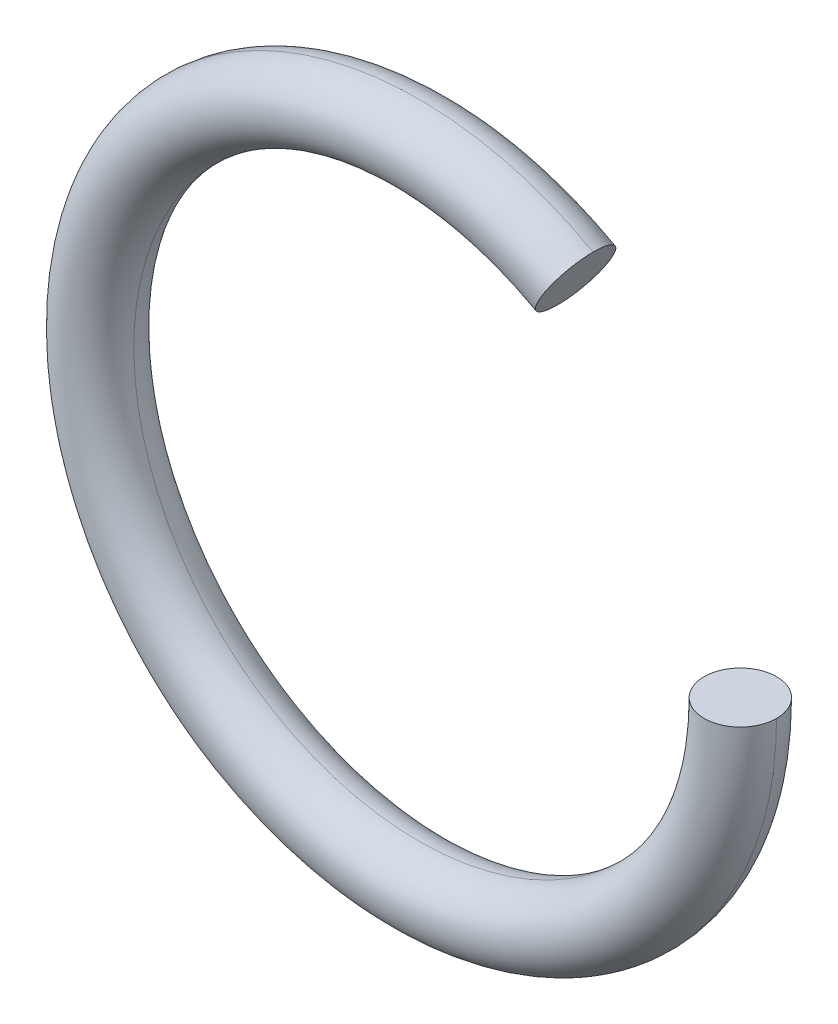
ISO-10303-21;
HEADER;
FILE_DESCRIPTION(('STEP AP214'),'2;1');
FILE_NAME('part.step','',(''),(''),'','','');
FILE_SCHEMA(('AUTOMOTIVE_DESIGN { 1 0 10303 214 1 1 1 1 }'));
ENDSEC;
DATA;
#1=APPLICATION_CONTEXT('core data for automotive mechanical design processes');
#2=APPLICATION_PROTOCOL_DEFINITION('international standard','automotive_design',2000,#1);
#3=PRODUCT_CONTEXT('',#1,'mechanical');
#4=PRODUCT('Part','Part','',(#3));
#5=PRODUCT_RELATED_PRODUCT_CATEGORY('part','',(#4));
#6=PRODUCT_DEFINITION_FORMATION('','',#4);
#7=PRODUCT_DEFINITION_CONTEXT('part definition',#1,'design');
#8=PRODUCT_DEFINITION('design','',#6,#7);
#9=PRODUCT_DEFINITION_SHAPE('','',#8);
#10=(LENGTH_UNIT() NAMED_UNIT(*) SI_UNIT(.MILLI.,.METRE.));
#11=(NAMED_UNIT(*) PLANE_ANGLE_UNIT() SI_UNIT($,.RADIAN.));
#12=(NAMED_UNIT(*) SI_UNIT($,.STERADIAN.) SOLID_ANGLE_UNIT());
#13=UNCERTAINTY_MEASURE_WITH_UNIT(LENGTH_MEASURE(1.E-05),#10,'distance_accuracy_value','');
#14=(GEOMETRIC_REPRESENTATION_CONTEXT(3) GLOBAL_UNCERTAINTY_ASSIGNED_CONTEXT((#13)) GLOBAL_UNIT_ASSIGNED_CONTEXT((#10,
#11,#12)) REPRESENTATION_CONTEXT('',''));
#15=CARTESIAN_POINT('',(0.,0.,0.));
#16=DIRECTION('',(0.,0.,1.));
#17=DIRECTION('',(1.,0.,0.));
#18=AXIS2_PLACEMENT_3D('',#15,#16,#17);
#19=CARTESIAN_POINT('',(0.,0.,0.));
#20=DIRECTION('',(0.,0.,1.));
#21=DIRECTION('',(1.,0.,0.));
#22=AXIS2_PLACEMENT_3D('',#19,#20,#21);
#23=TOROIDAL_SURFACE('',#22,3.55,0.4);
#24=CARTESIAN_POINT('',(1.72977888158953,3.10005887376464,0.));
#25=DIRECTION('',(-0.873256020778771,0.487261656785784,0.));
#26=DIRECTION('',(0.,0.,1.));
#27=AXIS2_PLACEMENT_3D('',#24,#25,#26);
#28=CIRCLE('',#27,0.4);
#29=CARTESIAN_POINT('',(1.92468354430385,3.44936128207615,0.));
#30=VERTEX_POINT('',#29);
#31=CARTESIAN_POINT('',(1.53487421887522,2.75075646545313,0.));
#32=VERTEX_POINT('',#31);
#33=EDGE_CURVE('E62',#30,#32,#28,.T.);
#34=ORIENTED_EDGE('',*,*,#33,.T.);
#35=CARTESIAN_POINT('',(0.,0.,0.));
#36=DIRECTION('',(0.,0.,1.));
#37=DIRECTION('',(-1.,0.,0.));
#38=AXIS2_PLACEMENT_3D('',#35,#36,#37);
#39=CIRCLE('',#38,3.15);
#40=CARTESIAN_POINT('',(3.15,0.,0.));
#41=VERTEX_POINT('',#40);
#42=EDGE_CURVE('E12',#32,#41,#39,.T.);
#43=ORIENTED_EDGE('',*,*,#42,.T.);
#44=CARTESIAN_POINT('',(3.55,0.,0.));
#45=DIRECTION('',(0.,1.,0.));
#46=DIRECTION('',(0.,0.,1.));
#47=AXIS2_PLACEMENT_3D('',#44,#45,#46);
#48=CIRCLE('',#47,0.4);
#49=CARTESIAN_POINT('',(3.95,0.,0.));
#50=VERTEX_POINT('',#49);
#51=EDGE_CURVE('E63',#50,#41,#48,.T.);
#52=ORIENTED_EDGE('',*,*,#51,.F.);
#53=CARTESIAN_POINT('',(0.,0.,0.));
#54=DIRECTION('',(0.,0.,-1.));
#55=DIRECTION('',(1.,0.,0.));
#56=AXIS2_PLACEMENT_3D('',#53,#54,#55);
#57=CIRCLE('',#56,3.95);
#58=EDGE_CURVE('E42',#50,#30,#57,.T.);
#59=ORIENTED_EDGE('',*,*,#58,.T.);
#60=EDGE_LOOP('',(#34,#43,#52,#59));
#61=FACE_BOUND('',#60,.T.);
#62=ADVANCED_FACE('F34',(#61),#23,.T.);
#63=ORIENTED_EDGE('',*,*,#42,.F.);
#64=EDGE_CURVE('E58',#32,#30,#28,.T.);
#65=ORIENTED_EDGE('',*,*,#64,.T.);
#66=ORIENTED_EDGE('',*,*,#58,.F.);
#67=EDGE_CURVE('E68',#41,#50,#48,.T.);
#68=ORIENTED_EDGE('',*,*,#67,.F.);
#69=EDGE_LOOP('',(#63,#65,#66,#68));
#70=FACE_BOUND('',#69,.T.);
#71=ADVANCED_FACE('F36',(#70),#23,.T.);
#72=CARTESIAN_POINT('',(1.72977888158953,3.10005887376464,0.));
#73=DIRECTION('',(-0.873256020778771,0.487261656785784,0.));
#74=DIRECTION('',(0.,0.,1.));
#75=AXIS2_PLACEMENT_3D('',#72,#73,#74);
#76=PLANE('',#75);
#77=ORIENTED_EDGE('',*,*,#33,.F.);
#78=ORIENTED_EDGE('',*,*,#64,.F.);
#79=EDGE_LOOP('',(#77,#78));
#80=FACE_BOUND('',#79,.T.);
#81=ADVANCED_FACE('F66',(#80),#76,.F.);
#82=CARTESIAN_POINT('',(3.55,0.,0.));
#83=DIRECTION('',(0.,1.,0.));
#84=DIRECTION('',(0.,0.,1.));
#85=AXIS2_PLACEMENT_3D('',#82,#83,#84);
#86=PLANE('',#85);
#87=ORIENTED_EDGE('',*,*,#51,.T.);
#88=ORIENTED_EDGE('',*,*,#67,.T.);
#89=EDGE_LOOP('',(#87,#88));
#90=FACE_BOUND('',#89,.T.);
#91=ADVANCED_FACE('F70',(#90),#86,.T.);
#92=CLOSED_SHELL('',(#62,#71,#81,#91));
#93=MANIFOLD_SOLID_BREP('B2',#92);
#94=ADVANCED_BREP_SHAPE_REPRESENTATION('',(#18,#93),#14);
#95=SHAPE_DEFINITION_REPRESENTATION(#9,#94);
ENDSEC;
END-ISO-10303-21;
